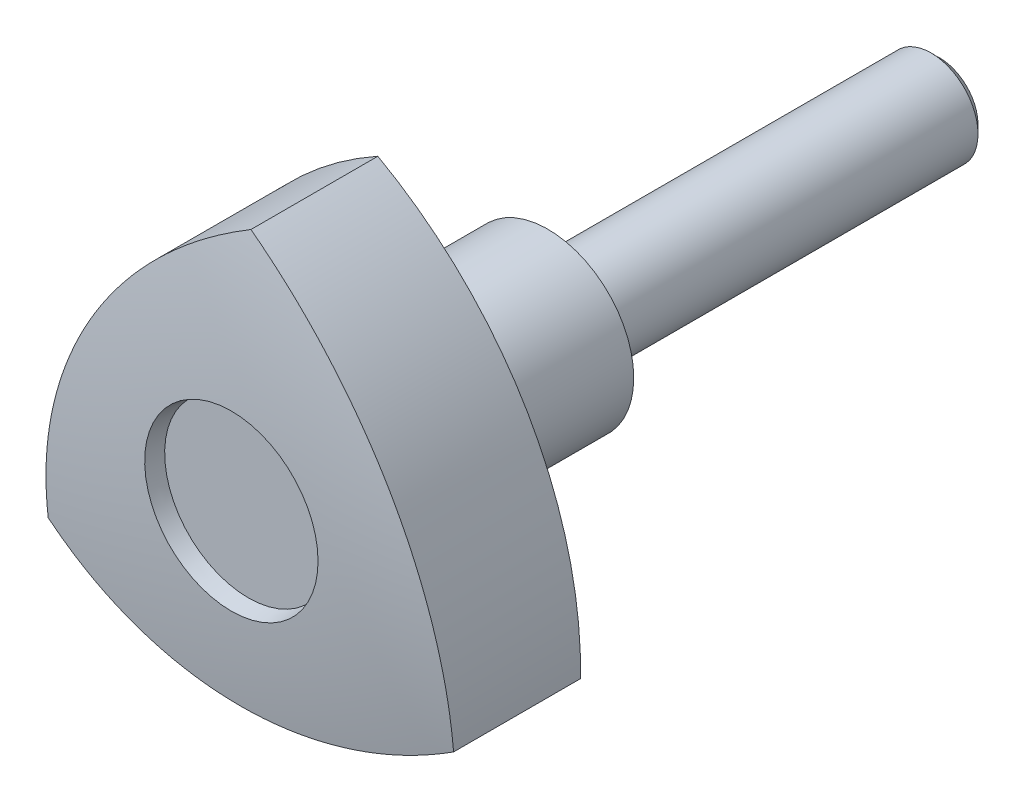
ISO-10303-21;
HEADER;
FILE_DESCRIPTION(('STEP AP214'),'2;1');
FILE_NAME('part.step','',(''),(''),'','','');
FILE_SCHEMA(('AUTOMOTIVE_DESIGN { 1 0 10303 214 1 1 1 1 }'));
ENDSEC;
DATA;
#1=APPLICATION_CONTEXT('core data for automotive mechanical design processes');
#2=APPLICATION_PROTOCOL_DEFINITION('international standard','automotive_design',2000,#1);
#3=PRODUCT_CONTEXT('',#1,'mechanical');
#4=PRODUCT('Part','Part','',(#3));
#5=PRODUCT_RELATED_PRODUCT_CATEGORY('part','',(#4));
#6=PRODUCT_DEFINITION_FORMATION('','',#4);
#7=PRODUCT_DEFINITION_CONTEXT('part definition',#1,'design');
#8=PRODUCT_DEFINITION('design','',#6,#7);
#9=PRODUCT_DEFINITION_SHAPE('','',#8);
#10=(LENGTH_UNIT() NAMED_UNIT(*) SI_UNIT(.MILLI.,.METRE.));
#11=(NAMED_UNIT(*) PLANE_ANGLE_UNIT() SI_UNIT($,.RADIAN.));
#12=(NAMED_UNIT(*) SI_UNIT($,.STERADIAN.) SOLID_ANGLE_UNIT());
#13=UNCERTAINTY_MEASURE_WITH_UNIT(LENGTH_MEASURE(1.E-05),#10,'distance_accuracy_value','');
#14=(GEOMETRIC_REPRESENTATION_CONTEXT(3) GLOBAL_UNCERTAINTY_ASSIGNED_CONTEXT((#13)) GLOBAL_UNIT_ASSIGNED_CONTEXT((#10,
#11,#12)) REPRESENTATION_CONTEXT('',''));
#15=CARTESIAN_POINT('',(0.,0.,0.));
#16=DIRECTION('',(0.,0.,1.));
#17=DIRECTION('',(1.,0.,0.));
#18=AXIS2_PLACEMENT_3D('',#15,#16,#17);
#19=CARTESIAN_POINT('',(0.,-7.79999999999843,22.));
#20=DIRECTION('',(0.,0.,-1.));
#21=DIRECTION('',(1.,0.,0.));
#22=AXIS2_PLACEMENT_3D('',#19,#20,#21);
#23=PLANE('',#22);
#24=CARTESIAN_POINT('',(0.,0.,22.));
#25=DIRECTION('',(0.,0.,1.));
#26=DIRECTION('',(0.,-1.,0.));
#27=AXIS2_PLACEMENT_3D('',#24,#25,#26);
#28=CIRCLE('',#27,7.79999999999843);
#29=CARTESIAN_POINT('',(0.,-7.79999999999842,22.));
#30=VERTEX_POINT('',#29);
#31=EDGE_CURVE('E19',#30,#30,#28,.T.);
#32=ORIENTED_EDGE('',*,*,#31,.T.);
#33=EDGE_LOOP('',(#32));
#34=FACE_BOUND('',#33,.T.);
#35=ADVANCED_FACE('F14',(#34),#23,.F.);
#36=CARTESIAN_POINT('',(0.,0.,37.));
#37=DIRECTION('',(0.,0.,1.));
#38=DIRECTION('',(0.,-1.,0.));
#39=AXIS2_PLACEMENT_3D('',#36,#37,#38);
#40=CONICAL_SURFACE('',#39,10.4449047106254,0.174532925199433);
#41=CARTESIAN_POINT('',(0.,0.,37.));
#42=DIRECTION('',(0.,0.,1.));
#43=DIRECTION('',(0.,-1.,0.));
#44=AXIS2_PLACEMENT_3D('',#41,#42,#43);
#45=CIRCLE('',#44,10.4449047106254);
#46=CARTESIAN_POINT('',(0.,-10.4449047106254,37.));
#47=VERTEX_POINT('',#46);
#48=EDGE_CURVE('E137',#47,#47,#45,.T.);
#49=ORIENTED_EDGE('',*,*,#48,.T.);
#50=EDGE_LOOP('',(#49));
#51=FACE_BOUND('',#50,.T.);
#52=ORIENTED_EDGE('',*,*,#31,.F.);
#53=EDGE_LOOP('',(#52));
#54=FACE_BOUND('',#53,.T.);
#55=ADVANCED_FACE('F145',(#51,#54),#40,.F.);
#56=CARTESIAN_POINT('',(0.,-0.000999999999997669,37.));
#57=DIRECTION('',(0.,0.,1.));
#58=DIRECTION('',(-1.,0.,0.));
#59=AXIS2_PLACEMENT_3D('',#56,#57,#58);
#60=PLANE('',#59);
#61=CARTESIAN_POINT('',(0.,0.,37.));
#62=DIRECTION('',(0.,0.,-1.));
#63=DIRECTION('',(1.,0.,0.));
#64=AXIS2_PLACEMENT_3D('',#61,#62,#63);
#65=CIRCLE('',#64,0.0009999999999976);
#66=CARTESIAN_POINT('',(0.0009999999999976,0.,37.));
#67=VERTEX_POINT('',#66);
#68=EDGE_CURVE('E135',#67,#67,#65,.F.);
#69=ORIENTED_EDGE('',*,*,#68,.T.);
#70=EDGE_LOOP('',(#69));
#71=FACE_BOUND('',#70,.T.);
#72=ORIENTED_EDGE('',*,*,#48,.F.);
#73=EDGE_LOOP('',(#72));
#74=FACE_BOUND('',#73,.T.);
#75=ADVANCED_FACE('F147',(#71,#74),#60,.F.);
#76=CARTESIAN_POINT('',(0.,0.,22.));
#77=DIRECTION('',(0.,0.,-1.));
#78=DIRECTION('',(1.,0.,0.));
#79=AXIS2_PLACEMENT_3D('',#76,#77,#78);
#80=CYLINDRICAL_SURFACE('',#79,0.0009999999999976);
#81=CARTESIAN_POINT('',(0.,0.,38.6));
#82=DIRECTION('',(0.,0.,-1.));
#83=DIRECTION('',(1.,0.,0.));
#84=AXIS2_PLACEMENT_3D('',#81,#82,#83);
#85=CIRCLE('',#84,0.0009999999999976);
#86=CARTESIAN_POINT('',(0.0009999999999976,0.,38.6));
#87=VERTEX_POINT('',#86);
#88=EDGE_CURVE('E132',#87,#87,#85,.F.);
#89=ORIENTED_EDGE('',*,*,#88,.T.);
#90=EDGE_LOOP('',(#89));
#91=FACE_BOUND('',#90,.T.);
#92=ORIENTED_EDGE('',*,*,#68,.F.);
#93=EDGE_LOOP('',(#92));
#94=FACE_BOUND('',#93,.T.);
#95=ADVANCED_FACE('F154',(#91,#94),#80,.F.);
#96=CARTESIAN_POINT('',(0.,-10.727027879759,38.6));
#97=DIRECTION('',(0.,0.,-1.));
#98=DIRECTION('',(1.,0.,0.));
#99=AXIS2_PLACEMENT_3D('',#96,#97,#98);
#100=PLANE('',#99);
#101=CARTESIAN_POINT('',(0.,0.,38.6));
#102=DIRECTION('',(0.,0.,1.));
#103=DIRECTION('',(0.,-1.,0.));
#104=AXIS2_PLACEMENT_3D('',#101,#102,#103);
#105=CIRCLE('',#104,10.7270278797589);
#106=CARTESIAN_POINT('',(0.,-10.7270278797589,38.6));
#107=VERTEX_POINT('',#106);
#108=EDGE_CURVE('E77',#107,#107,#105,.T.);
#109=ORIENTED_EDGE('',*,*,#108,.T.);
#110=EDGE_LOOP('',(#109));
#111=FACE_BOUND('',#110,.T.);
#112=ORIENTED_EDGE('',*,*,#88,.F.);
#113=EDGE_LOOP('',(#112));
#114=FACE_BOUND('',#113,.T.);
#115=ADVANCED_FACE('F224',(#111,#114),#100,.F.);
#116=CARTESIAN_POINT('',(0.,0.,40.7763902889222));
#117=DIRECTION('',(0.,0.,1.));
#118=DIRECTION('',(0.,-1.,0.));
#119=AXIS2_PLACEMENT_3D('',#116,#117,#118);
#120=CONICAL_SURFACE('',#119,11.1107842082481,0.17453292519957);
#121=CARTESIAN_POINT('',(0.,0.,40.7763902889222));
#122=DIRECTION('',(0.,0.,-1.));
#123=DIRECTION('',(1.,0.,0.));
#124=AXIS2_PLACEMENT_3D('',#121,#122,#123);
#125=CIRCLE('',#124,11.1107842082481);
#126=CARTESIAN_POINT('',(11.1107842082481,0.,40.7763902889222));
#127=VERTEX_POINT('',#126);
#128=EDGE_CURVE('E59',#127,#127,#125,.T.);
#129=ORIENTED_EDGE('',*,*,#128,.F.);
#130=EDGE_LOOP('',(#129));
#131=FACE_BOUND('',#130,.T.);
#132=ORIENTED_EDGE('',*,*,#108,.F.);
#133=EDGE_LOOP('',(#132));
#134=FACE_BOUND('',#133,.T.);
#135=ADVANCED_FACE('F123',(#131,#134),#120,.F.);
#136=CARTESIAN_POINT('',(0.,0.,-93.7719850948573));
#137=DIRECTION('',(0.,0.,1.));
#138=DIRECTION('',(-1.,0.,0.));
#139=AXIS2_PLACEMENT_3D('',#136,#137,#138);
#140=DEGENERATE_TOROIDAL_SURFACE('',#139,2.84529320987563,134.802016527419,.T.);
#141=ORIENTED_EDGE('',*,*,#128,.T.);
#142=EDGE_LOOP('',(#141));
#143=FACE_BOUND('',#142,.T.);
#144=CARTESIAN_POINT('',(0.,30.,38.2666666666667));
#145=CARTESIAN_POINT('',(0.558307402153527,29.6902588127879,38.3303674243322));
#146=CARTESIAN_POINT('',(1.11086881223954,29.3698498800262,38.3919197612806));
#147=CARTESIAN_POINT('',(2.20377539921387,28.7080755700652,38.5106833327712));
#148=CARTESIAN_POINT('',(2.74412054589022,28.3667101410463,38.5678945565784));
#149=CARTESIAN_POINT('',(4.34547338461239,27.3119264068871,38.73292211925));
#150=CARTESIAN_POINT('',(5.38707918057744,26.5676649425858,38.8341643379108));
#151=CARTESIAN_POINT('',(7.41159109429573,25.0013846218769,39.0187399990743));
#152=CARTESIAN_POINT('',(8.39449779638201,24.1793665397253,39.1020736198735));
#153=CARTESIAN_POINT('',(10.2957526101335,22.4621694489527,39.250671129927));
#154=CARTESIAN_POINT('',(11.2140973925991,21.5669866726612,39.3159340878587));
#155=CARTESIAN_POINT('',(13.0633448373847,19.621541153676,39.4335816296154));
#156=CARTESIAN_POINT('',(13.9873565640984,18.5646072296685,39.4841857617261));
#157=CARTESIAN_POINT('',(15.7445448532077,16.3768862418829,39.56369719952));
#158=CARTESIAN_POINT('',(16.5777143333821,15.2460934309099,39.5926028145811));
#159=CARTESIAN_POINT('',(18.1472391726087,12.9185360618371,39.6287660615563));
#160=CARTESIAN_POINT('',(18.8835749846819,11.7217582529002,39.6360193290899));
#161=CARTESIAN_POINT('',(20.253869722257,9.2711038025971,39.6288830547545));
#162=CARTESIAN_POINT('',(20.8878339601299,8.01723012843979,39.6144946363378));
#163=CARTESIAN_POINT('',(22.0459926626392,5.4678270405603,39.5641714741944));
#164=CARTESIAN_POINT('',(22.5707242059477,4.17253939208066,39.5283456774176));
#165=CARTESIAN_POINT('',(23.5108690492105,1.54344131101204,39.4351850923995));
#166=CARTESIAN_POINT('',(23.9262693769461,0.209626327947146,39.3778477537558));
#167=CARTESIAN_POINT('',(24.6445181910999,-2.48523576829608,39.2417613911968));
#168=CARTESIAN_POINT('',(24.9474912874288,-3.84625095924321,39.1630362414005));
#169=CARTESIAN_POINT('',(25.4395881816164,-6.58692361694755,38.984301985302));
#170=CARTESIAN_POINT('',(25.6287645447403,-7.96657217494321,38.8843027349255));
#171=CARTESIAN_POINT('',(25.8054099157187,-9.82058108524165,38.7363291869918));
#172=CARTESIAN_POINT('',(25.8435905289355,-10.2912655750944,38.6975947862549));
#173=CARTESIAN_POINT('',(25.9067185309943,-11.2332433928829,38.6177315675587));
#174=CARTESIAN_POINT('',(25.9316688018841,-11.7045365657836,38.5766032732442));
#175=CARTESIAN_POINT('',(25.9683048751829,-12.6465522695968,38.4920437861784));
#176=CARTESIAN_POINT('',(25.9800149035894,-13.1172742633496,38.4486169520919));
#177=CARTESIAN_POINT('',(25.9902663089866,-14.058739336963,38.3594040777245));
#178=CARTESIAN_POINT('',(25.988804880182,-14.5294823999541,38.3136175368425));
#179=CARTESIAN_POINT('',(25.9807621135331,-15.0000000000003,38.2666666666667));
#180=B_SPLINE_CURVE_WITH_KNOTS('',3,(#144,#145,#146,#147,#148,#149,#150,#151,#152,#153,#154,
#155,#156,#157,#158,#159,#160,#161,#162,#163,#164,#165,#166,#167,#168,#169,#170,#171,#172,#173,
#174,#175,#176,#177,#178,#179),.UNSPECIFIED.,.F.,.F.,(4,2,2,2,2,2,2,2,2,2,2,2,2,2,2,2,2,4),(0.,
1.92468080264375,3.84936636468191,7.69777230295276,11.5461399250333,15.394705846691,
19.6039988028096,23.8136196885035,28.0240890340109,32.2343398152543,36.4233732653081,
40.6129035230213,44.7977763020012,48.9807145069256,50.4020406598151,51.8230570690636,
53.2414691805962,54.6601834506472),.UNSPECIFIED.);
#181=CARTESIAN_POINT('',(0.,30.,38.2666666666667));
#182=VERTEX_POINT('',#181);
#183=CARTESIAN_POINT('',(25.9807621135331,-15.,38.2666666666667));
#184=VERTEX_POINT('',#183);
#185=EDGE_CURVE('E49',#182,#184,#180,.T.);
#186=ORIENTED_EDGE('',*,*,#185,.F.);
#187=CARTESIAN_POINT('',(-25.9807621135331,-14.9999999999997,38.2666666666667));
#188=CARTESIAN_POINT('',(-25.9916720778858,-14.3616210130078,38.3303674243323));
#189=CARTESIAN_POINT('',(-25.9904705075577,-13.7228843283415,38.3919197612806));
#190=CARTESIAN_POINT('',(-25.9638104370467,-12.4455123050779,38.5106833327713));
#191=CARTESIAN_POINT('',(-25.9383518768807,-11.8068769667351,38.5678945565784));
#192=CARTESIAN_POINT('',(-25.8255587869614,-9.89267286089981,38.7329221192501));
#193=CARTESIAN_POINT('',(-25.7018123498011,-8.61848504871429,38.8341643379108));
#194=CARTESIAN_POINT('',(-25.3576297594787,-6.08206614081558,39.0187399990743));
#195=CARTESIAN_POINT('',(-25.1371945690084,-4.81983492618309,39.1020736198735));
#196=CARTESIAN_POINT('',(-24.6006856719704,-2.31470141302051,39.250671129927));
#197=CARTESIAN_POINT('',(-24.2846070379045,-1.07180011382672,39.3159340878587));
#198=CARTESIAN_POINT('',(-23.5244255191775,1.50241791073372,39.4335816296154));
#199=CARTESIAN_POINT('',(-23.0710997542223,2.8311025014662,39.4841857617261));
#200=CARTESIAN_POINT('',(-22.0550719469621,5.44673269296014,39.56369719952));
#201=CARTESIAN_POINT('',(-21.4923613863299,6.73367503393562,39.5926028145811));
#202=CARTESIAN_POINT('',(-20.2613999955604,9.25670210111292,39.6287660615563));
#203=CARTESIAN_POINT('',(-19.5931279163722,10.4927765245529,39.63601932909));
#204=CARTESIAN_POINT('',(-18.1559462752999,12.9048138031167,39.6288830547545));
#205=CARTESIAN_POINT('',(-17.3870419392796,14.0807797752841,39.6144946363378));
#206=CARTESIAN_POINT('',(-15.7582734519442,16.3584761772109,39.5641714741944));
#207=CARTESIAN_POINT('',(-14.8988872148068,17.4605508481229,39.5283456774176));
#208=CARTESIAN_POINT('',(-13.0920939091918,19.5892892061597,39.4351850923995));
#209=CARTESIAN_POINT('',(-12.1446764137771,20.6159439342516,39.3778477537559));
#210=CARTESIAN_POINT('',(-10.1699817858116,22.5853967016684,39.2417613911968));
#211=CARTESIAN_POINT('',(-9.1427946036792,23.528286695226,39.1630362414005));
#212=CARTESIAN_POINT('',(-7.01535090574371,25.3247914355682,38.984301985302));
#213=CARTESIAN_POINT('',(-5.91512838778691,26.1784472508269,38.8843027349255));
#214=CARTESIAN_POINT('',(-4.39783225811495,27.2584310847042,38.7363291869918));
#215=CARTESIAN_POINT('',(-4.00929783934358,27.5268387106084,38.6975947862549));
#216=CARTESIAN_POINT('',(-3.22508512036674,28.0524980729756,38.6177315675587));
#217=CARTESIAN_POINT('',(-2.82940839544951,28.3097522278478,38.5766032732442));
#218=CARTESIAN_POINT('',(-2.03191690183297,28.812487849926,38.4920437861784));
#219=CARTESIAN_POINT('',(-1.63011471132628,29.0579900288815,38.4486169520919));
#220=CARTESIAN_POINT('',(-0.819907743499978,29.5376005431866,38.3594040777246));
#221=CARTESIAN_POINT('',(-0.411501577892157,29.7717064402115,38.3136175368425));
#222=CARTESIAN_POINT('',(-1.01380807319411E-13,30.,38.2666666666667));
#223=B_SPLINE_CURVE_WITH_KNOTS('',3,(#187,#188,#189,#190,#191,#192,#193,#194,#195,#196,#197,
#198,#199,#200,#201,#202,#203,#204,#205,#206,#207,#208,#209,#210,#211,#212,#213,#214,#215,#216,
#217,#218,#219,#220,#221,#222),.UNSPECIFIED.,.F.,.F.,(4,2,2,2,2,2,2,2,2,2,2,2,2,2,2,2,2,4),(0.,
1.92468080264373,3.84936636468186,7.69777230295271,11.5461399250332,15.394705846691,
19.6039988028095,23.8136196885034,28.0240890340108,32.2343398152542,36.423373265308,
40.6129035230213,44.7977763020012,48.9807145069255,50.4020406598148,51.8230570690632,
53.2414691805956,54.6601834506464),.UNSPECIFIED.);
#224=CARTESIAN_POINT('',(-25.9807621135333,-14.9999999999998,38.2666666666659));
#225=VERTEX_POINT('',#224);
#226=EDGE_CURVE('E58',#225,#182,#223,.T.);
#227=ORIENTED_EDGE('',*,*,#226,.F.);
#228=CARTESIAN_POINT('',(25.980762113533,-15.,38.2666666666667));
#229=CARTESIAN_POINT('',(25.4333646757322,-15.3286377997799,38.3303674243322));
#230=CARTESIAN_POINT('',(24.879601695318,-15.6469655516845,38.3919197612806));
#231=CARTESIAN_POINT('',(23.7600350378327,-16.2625632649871,38.5106833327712));
#232=CARTESIAN_POINT('',(23.1942313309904,-16.559833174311,38.5678945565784));
#233=CARTESIAN_POINT('',(21.4800854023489,-17.4192535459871,38.7329221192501));
#234=CARTESIAN_POINT('',(20.3147331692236,-17.9491798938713,38.8341643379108));
#235=CARTESIAN_POINT('',(17.9460386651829,-18.9193184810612,39.0187399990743));
#236=CARTESIAN_POINT('',(16.7426967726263,-19.359531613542,39.1020736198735));
#237=CARTESIAN_POINT('',(14.3049330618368,-20.147468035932,39.250671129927));
#238=CARTESIAN_POINT('',(13.0705096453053,-20.4951865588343,39.3159340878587));
#239=CARTESIAN_POINT('',(10.4610806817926,-21.1239590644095,39.4335816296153));
#240=CARTESIAN_POINT('',(9.08374319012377,-21.3957097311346,39.4841857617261));
#241=CARTESIAN_POINT('',(6.31052709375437,-21.8236189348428,39.56369719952));
#242=CARTESIAN_POINT('',(4.91464705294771,-21.9797684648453,39.5926028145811));
#243=CARTESIAN_POINT('',(2.1141608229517,-22.1752381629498,39.6287660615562));
#244=CARTESIAN_POINT('',(0.709552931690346,-22.214534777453,39.63601932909));
#245=CARTESIAN_POINT('',(-2.09792344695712,-22.1759176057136,39.6288830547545));
#246=CARTESIAN_POINT('',(-3.50079202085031,-22.0980099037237,39.6144946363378));
#247=CARTESIAN_POINT('',(-6.28771921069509,-21.826303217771,39.5641714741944));
#248=CARTESIAN_POINT('',(-7.67183699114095,-21.6330902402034,39.5283456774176));
#249=CARTESIAN_POINT('',(-10.4187751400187,-21.1327305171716,39.4351850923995));
#250=CARTESIAN_POINT('',(-11.781592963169,-20.8255702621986,39.3778477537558));
#251=CARTESIAN_POINT('',(-14.4745364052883,-20.1001609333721,39.2417613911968));
#252=CARTESIAN_POINT('',(-15.8046966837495,-19.6820357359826,39.1630362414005));
#253=CARTESIAN_POINT('',(-18.4242372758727,-18.7378678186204,38.984301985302));
#254=CARTESIAN_POINT('',(-19.7136361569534,-18.2118750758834,38.8843027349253));
#255=CARTESIAN_POINT('',(-21.4075776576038,-17.4378499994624,38.7363291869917));
#256=CARTESIAN_POINT('',(-21.834292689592,-17.2355731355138,38.6975947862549));
#257=CARTESIAN_POINT('',(-22.6816334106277,-16.8192546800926,38.6177315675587));
#258=CARTESIAN_POINT('',(-23.1022604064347,-16.6052156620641,38.5766032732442));
#259=CARTESIAN_POINT('',(-23.9363879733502,-16.1659355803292,38.4920437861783));
#260=CARTESIAN_POINT('',(-24.3499001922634,-15.9407157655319,38.4486169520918));
#261=CARTESIAN_POINT('',(-25.170358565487,-15.4788612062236,38.3594040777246));
#262=CARTESIAN_POINT('',(-25.5773033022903,-15.2422240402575,38.3136175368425));
#263=CARTESIAN_POINT('',(-25.9807621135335,-14.9999999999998,38.2666666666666));
#264=B_SPLINE_CURVE_WITH_KNOTS('',3,(#228,#229,#230,#231,#232,#233,#234,#235,#236,#237,#238,
#239,#240,#241,#242,#243,#244,#245,#246,#247,#248,#249,#250,#251,#252,#253,#254,#255,#256,#257,
#258,#259,#260,#261,#262,#263),.UNSPECIFIED.,.F.,.F.,(4,2,2,2,2,2,2,2,2,2,2,2,2,2,2,2,2,4),(0.,
1.92468080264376,3.84936636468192,7.69777230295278,11.5461399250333,15.3947058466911,
19.6039988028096,23.8136196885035,28.0240890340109,32.2343398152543,36.4233732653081,
40.6129035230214,44.7977763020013,48.9807145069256,50.4020406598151,51.8230570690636,
53.2414691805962,54.6601834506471),.UNSPECIFIED.);
#265=EDGE_CURVE('E62',#184,#225,#264,.T.);
#266=ORIENTED_EDGE('',*,*,#265,.F.);
#267=EDGE_LOOP('',(#186,#227,#266));
#268=FACE_BOUND('',#267,.T.);
#269=ADVANCED_FACE('F16',(#143,#268),#140,.T.);
#270=CARTESIAN_POINT('',(-24.486868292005,-14.1375,60.));
#271=DIRECTION('',(0.,0.,1.));
#272=DIRECTION('',(-1.,0.,0.));
#273=AXIS2_PLACEMENT_3D('',#270,#271,#272);
#274=CYLINDRICAL_SURFACE('',#273,50.475);
#275=DIRECTION('',(0.,0.,1.));
#276=VECTOR('',#275,1.);
#277=CARTESIAN_POINT('',(25.9807621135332,-15.,60.));
#278=LINE('',#277,#276);
#279=CARTESIAN_POINT('',(25.9807621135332,-15.,22.));
#280=VERTEX_POINT('',#279);
#281=EDGE_CURVE('E54',#280,#184,#278,.T.);
#282=ORIENTED_EDGE('',*,*,#281,.F.);
#283=CARTESIAN_POINT('',(-24.486868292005,-14.1375,22.));
#284=DIRECTION('',(0.,0.,1.));
#285=DIRECTION('',(-1.,0.,0.));
#286=AXIS2_PLACEMENT_3D('',#283,#284,#285);
#287=CIRCLE('',#286,50.475);
#288=CARTESIAN_POINT('',(0.,30.,22.));
#289=VERTEX_POINT('',#288);
#290=EDGE_CURVE('E99',#280,#289,#287,.T.);
#291=ORIENTED_EDGE('',*,*,#290,.T.);
#292=DIRECTION('',(0.,0.,1.));
#293=VECTOR('',#292,1.);
#294=CARTESIAN_POINT('',(0.,30.,60.));
#295=LINE('',#294,#293);
#296=EDGE_CURVE('E56',#182,#289,#295,.F.);
#297=ORIENTED_EDGE('',*,*,#296,.F.);
#298=ORIENTED_EDGE('',*,*,#185,.T.);
#299=EDGE_LOOP('',(#282,#291,#297,#298));
#300=FACE_BOUND('',#299,.T.);
#301=ADVANCED_FACE('F52',(#300),#274,.T.);
#302=CARTESIAN_POINT('',(24.4868682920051,-14.1375,60.));
#303=DIRECTION('',(0.,0.,1.));
#304=DIRECTION('',(-1.,0.,0.));
#305=AXIS2_PLACEMENT_3D('',#302,#303,#304);
#306=CYLINDRICAL_SURFACE('',#305,50.475);
#307=ORIENTED_EDGE('',*,*,#296,.T.);
#308=CARTESIAN_POINT('',(24.4868682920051,-14.1375,22.));
#309=DIRECTION('',(0.,0.,1.));
#310=DIRECTION('',(-1.,0.,0.));
#311=AXIS2_PLACEMENT_3D('',#308,#309,#310);
#312=CIRCLE('',#311,50.475);
#313=CARTESIAN_POINT('',(-25.9807621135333,-15.,22.));
#314=VERTEX_POINT('',#313);
#315=EDGE_CURVE('E34',#289,#314,#312,.T.);
#316=ORIENTED_EDGE('',*,*,#315,.T.);
#317=DIRECTION('',(0.,0.,1.));
#318=VECTOR('',#317,1.);
#319=CARTESIAN_POINT('',(-25.9807621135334,-14.9999999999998,60.));
#320=LINE('',#319,#318);
#321=EDGE_CURVE('E64',#225,#314,#320,.F.);
#322=ORIENTED_EDGE('',*,*,#321,.F.);
#323=ORIENTED_EDGE('',*,*,#226,.T.);
#324=EDGE_LOOP('',(#307,#316,#322,#323));
#325=FACE_BOUND('',#324,.T.);
#326=ADVANCED_FACE('F115',(#325),#306,.T.);
#327=CARTESIAN_POINT('',(0.,28.275,60.));
#328=DIRECTION('',(0.,0.,1.));
#329=DIRECTION('',(-1.,0.,0.));
#330=AXIS2_PLACEMENT_3D('',#327,#328,#329);
#331=CYLINDRICAL_SURFACE('',#330,50.475);
#332=ORIENTED_EDGE('',*,*,#321,.T.);
#333=CARTESIAN_POINT('',(0.,28.275,22.));
#334=DIRECTION('',(0.,0.,1.));
#335=DIRECTION('',(-1.,0.,0.));
#336=AXIS2_PLACEMENT_3D('',#333,#334,#335);
#337=CIRCLE('',#336,50.475);
#338=EDGE_CURVE('E68',#314,#280,#337,.T.);
#339=ORIENTED_EDGE('',*,*,#338,.T.);
#340=ORIENTED_EDGE('',*,*,#281,.T.);
#341=ORIENTED_EDGE('',*,*,#265,.T.);
#342=EDGE_LOOP('',(#332,#339,#340,#341));
#343=FACE_BOUND('',#342,.T.);
#344=ADVANCED_FACE('F66',(#343),#331,.T.);
#345=CARTESIAN_POINT('',(0.,-11.,22.));
#346=DIRECTION('',(0.,0.,1.));
#347=DIRECTION('',(-1.,0.,0.));
#348=AXIS2_PLACEMENT_3D('',#345,#346,#347);
#349=PLANE('',#348);
#350=CARTESIAN_POINT('',(0.,0.,22.));
#351=DIRECTION('',(0.,0.,-1.));
#352=DIRECTION('',(1.,0.,0.));
#353=AXIS2_PLACEMENT_3D('',#350,#351,#352);
#354=CIRCLE('',#353,11.);
#355=CARTESIAN_POINT('',(11.,0.,22.));
#356=VERTEX_POINT('',#355);
#357=EDGE_CURVE('E94',#356,#356,#354,.T.);
#358=ORIENTED_EDGE('',*,*,#357,.F.);
#359=EDGE_LOOP('',(#358));
#360=FACE_BOUND('',#359,.T.);
#361=ORIENTED_EDGE('',*,*,#315,.F.);
#362=ORIENTED_EDGE('',*,*,#290,.F.);
#363=ORIENTED_EDGE('',*,*,#338,.F.);
#364=EDGE_LOOP('',(#361,#362,#363));
#365=FACE_BOUND('',#364,.T.);
#366=ADVANCED_FACE('F114',(#360,#365),#349,.F.);
#367=CARTESIAN_POINT('',(0.,0.,22.));
#368=DIRECTION('',(0.,0.,-1.));
#369=DIRECTION('',(1.,0.,0.));
#370=AXIS2_PLACEMENT_3D('',#367,#368,#369);
#371=CYLINDRICAL_SURFACE('',#370,11.);
#372=CARTESIAN_POINT('',(0.,0.,0.200000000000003));
#373=DIRECTION('',(0.,0.,-1.));
#374=DIRECTION('',(1.,0.,0.));
#375=AXIS2_PLACEMENT_3D('',#372,#373,#374);
#376=CIRCLE('',#375,11.);
#377=CARTESIAN_POINT('',(11.,0.,0.200000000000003));
#378=VERTEX_POINT('',#377);
#379=EDGE_CURVE('E91',#378,#378,#376,.F.);
#380=ORIENTED_EDGE('',*,*,#379,.T.);
#381=EDGE_LOOP('',(#380));
#382=FACE_BOUND('',#381,.T.);
#383=ORIENTED_EDGE('',*,*,#357,.T.);
#384=EDGE_LOOP('',(#383));
#385=FACE_BOUND('',#384,.T.);
#386=ADVANCED_FACE('F183',(#382,#385),#371,.T.);
#387=CARTESIAN_POINT('',(0.,-7.8,0.200000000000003));
#388=DIRECTION('',(0.,0.,1.));
#389=DIRECTION('',(-1.,0.,0.));
#390=AXIS2_PLACEMENT_3D('',#387,#388,#389);
#391=PLANE('',#390);
#392=CARTESIAN_POINT('',(0.,0.,0.200000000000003));
#393=DIRECTION('',(0.,0.,-1.));
#394=DIRECTION('',(1.,0.,0.));
#395=AXIS2_PLACEMENT_3D('',#392,#393,#394);
#396=CIRCLE('',#395,7.8);
#397=CARTESIAN_POINT('',(7.8,0.,0.200000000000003));
#398=VERTEX_POINT('',#397);
#399=EDGE_CURVE('E88',#398,#398,#396,.T.);
#400=ORIENTED_EDGE('',*,*,#399,.F.);
#401=EDGE_LOOP('',(#400));
#402=FACE_BOUND('',#401,.T.);
#403=ORIENTED_EDGE('',*,*,#379,.F.);
#404=EDGE_LOOP('',(#403));
#405=FACE_BOUND('',#404,.T.);
#406=ADVANCED_FACE('F180',(#402,#405),#391,.F.);
#407=CARTESIAN_POINT('',(0.,0.,22.));
#408=DIRECTION('',(0.,0.,-1.));
#409=DIRECTION('',(1.,0.,0.));
#410=AXIS2_PLACEMENT_3D('',#407,#408,#409);
#411=CYLINDRICAL_SURFACE('',#410,7.8);
#412=CARTESIAN_POINT('',(0.,0.,0.));
#413=DIRECTION('',(0.,0.,-1.));
#414=DIRECTION('',(1.,0.,0.));
#415=AXIS2_PLACEMENT_3D('',#412,#413,#414);
#416=CIRCLE('',#415,7.8);
#417=CARTESIAN_POINT('',(7.8,0.,0.));
#418=VERTEX_POINT('',#417);
#419=EDGE_CURVE('E85',#418,#418,#416,.F.);
#420=ORIENTED_EDGE('',*,*,#419,.T.);
#421=EDGE_LOOP('',(#420));
#422=FACE_BOUND('',#421,.T.);
#423=ORIENTED_EDGE('',*,*,#399,.T.);
#424=EDGE_LOOP('',(#423));
#425=FACE_BOUND('',#424,.T.);
#426=ADVANCED_FACE('F176',(#422,#425),#411,.T.);
#427=CARTESIAN_POINT('',(0.,0.,-50.));
#428=DIRECTION('',(0.,0.,1.));
#429=DIRECTION('',(-1.,0.,0.));
#430=AXIS2_PLACEMENT_3D('',#427,#428,#429);
#431=PLANE('',#430);
#432=CARTESIAN_POINT('',(0.,0.,-50.0000000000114));
#433=DIRECTION('',(0.,0.,1.));
#434=DIRECTION('',(-1.,0.,0.));
#435=AXIS2_PLACEMENT_3D('',#432,#433,#434);
#436=CIRCLE('',#435,4.92650000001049);
#437=CARTESIAN_POINT('',(-4.92650000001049,0.,-50.0000000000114));
#438=VERTEX_POINT('',#437);
#439=EDGE_CURVE('E82',#438,#438,#436,.T.);
#440=ORIENTED_EDGE('',*,*,#439,.F.);
#441=EDGE_LOOP('',(#440));
#442=FACE_BOUND('',#441,.T.);
#443=ADVANCED_FACE('F172',(#442),#431,.F.);
#444=CARTESIAN_POINT('',(0.,-6.,0.));
#445=DIRECTION('',(0.,0.,1.));
#446=DIRECTION('',(-1.,0.,0.));
#447=AXIS2_PLACEMENT_3D('',#444,#445,#446);
#448=PLANE('',#447);
#449=CARTESIAN_POINT('',(0.,0.,0.));
#450=DIRECTION('',(0.,0.,-1.));
#451=DIRECTION('',(1.,0.,0.));
#452=AXIS2_PLACEMENT_3D('',#449,#450,#451);
#453=CIRCLE('',#452,6.);
#454=CARTESIAN_POINT('',(6.,0.,0.));
#455=VERTEX_POINT('',#454);
#456=EDGE_CURVE('E25',#455,#455,#453,.T.);
#457=ORIENTED_EDGE('',*,*,#456,.F.);
#458=EDGE_LOOP('',(#457));
#459=FACE_BOUND('',#458,.T.);
#460=ORIENTED_EDGE('',*,*,#419,.F.);
#461=EDGE_LOOP('',(#460));
#462=FACE_BOUND('',#461,.T.);
#463=ADVANCED_FACE('F165',(#459,#462),#448,.F.);
#464=CARTESIAN_POINT('',(0.,0.,-48.9265000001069));
#465=DIRECTION('',(0.,0.,1.));
#466=DIRECTION('',(-1.,0.,0.));
#467=AXIS2_PLACEMENT_3D('',#464,#465,#466);
#468=CONICAL_SURFACE('',#467,5.99999999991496,0.785398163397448);
#469=ORIENTED_EDGE('',*,*,#439,.T.);
#470=EDGE_LOOP('',(#469));
#471=FACE_BOUND('',#470,.T.);
#472=CARTESIAN_POINT('',(0.,0.,-48.9265));
#473=DIRECTION('',(0.,0.,-1.));
#474=DIRECTION('',(1.,0.,0.));
#475=AXIS2_PLACEMENT_3D('',#472,#473,#474);
#476=CIRCLE('',#475,6.);
#477=CARTESIAN_POINT('',(6.,0.,-48.9265));
#478=VERTEX_POINT('',#477);
#479=EDGE_CURVE('E9',#478,#478,#476,.F.);
#480=ORIENTED_EDGE('',*,*,#479,.F.);
#481=EDGE_LOOP('',(#480));
#482=FACE_BOUND('',#481,.T.);
#483=ADVANCED_FACE('F159',(#471,#482),#468,.T.);
#484=CARTESIAN_POINT('',(0.,0.,22.));
#485=DIRECTION('',(0.,0.,-1.));
#486=DIRECTION('',(1.,0.,0.));
#487=AXIS2_PLACEMENT_3D('',#484,#485,#486);
#488=CYLINDRICAL_SURFACE('',#487,6.);
#489=ORIENTED_EDGE('',*,*,#479,.T.);
#490=EDGE_LOOP('',(#489));
#491=FACE_BOUND('',#490,.T.);
#492=ORIENTED_EDGE('',*,*,#456,.T.);
#493=EDGE_LOOP('',(#492));
#494=FACE_BOUND('',#493,.T.);
#495=ADVANCED_FACE('F157',(#491,#494),#488,.T.);
#496=CLOSED_SHELL('',(#35,#55,#75,#95,#115,#135,#269,#301,#326,#344,#366,#386,#406,#426,#443,
#463,#483,#495));
#497=MANIFOLD_SOLID_BREP('B1',#496);
#498=ADVANCED_BREP_SHAPE_REPRESENTATION('',(#18,#497),#14);
#499=SHAPE_DEFINITION_REPRESENTATION(#9,#498);
ENDSEC;
END-ISO-10303-21;
